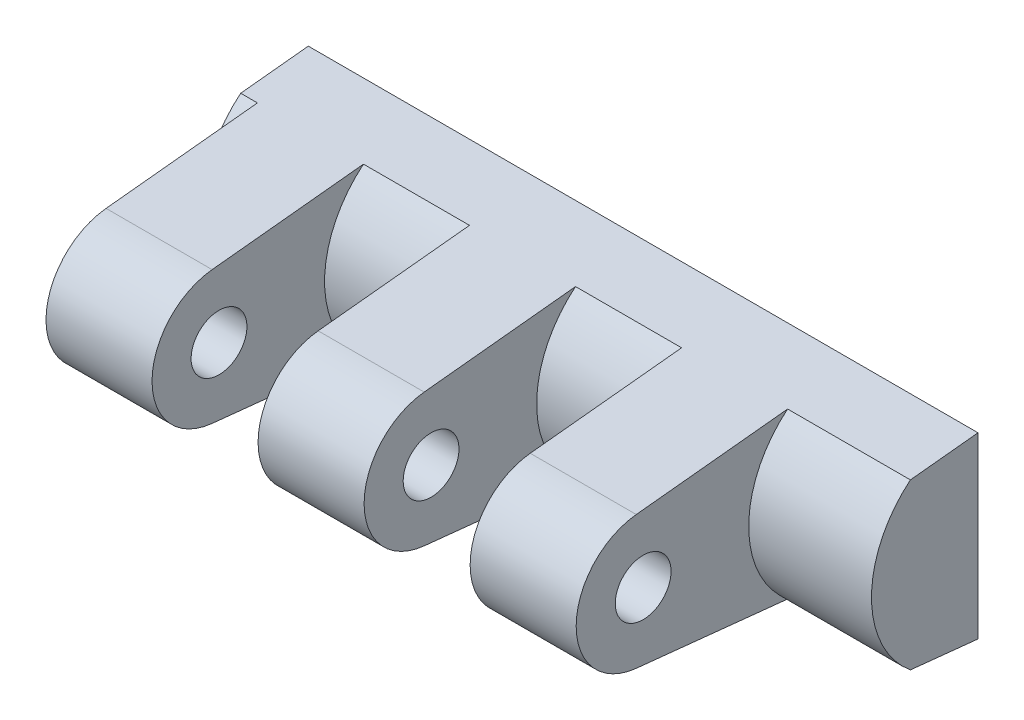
ISO-10303-21;
HEADER;
FILE_DESCRIPTION(('STEP AP214'),'2;1');
FILE_NAME('part.step','',(''),(''),'','','');
FILE_SCHEMA(('AUTOMOTIVE_DESIGN { 1 0 10303 214 1 1 1 1 }'));
ENDSEC;
DATA;
#1=APPLICATION_CONTEXT('core data for automotive mechanical design processes');
#2=APPLICATION_PROTOCOL_DEFINITION('international standard','automotive_design',2000,#1);
#3=PRODUCT_CONTEXT('',#1,'mechanical');
#4=PRODUCT('Part','Part','',(#3));
#5=PRODUCT_RELATED_PRODUCT_CATEGORY('part','',(#4));
#6=PRODUCT_DEFINITION_FORMATION('','',#4);
#7=PRODUCT_DEFINITION_CONTEXT('part definition',#1,'design');
#8=PRODUCT_DEFINITION('design','',#6,#7);
#9=PRODUCT_DEFINITION_SHAPE('','',#8);
#10=(LENGTH_UNIT() NAMED_UNIT(*) SI_UNIT(.MILLI.,.METRE.));
#11=(NAMED_UNIT(*) PLANE_ANGLE_UNIT() SI_UNIT($,.RADIAN.));
#12=(NAMED_UNIT(*) SI_UNIT($,.STERADIAN.) SOLID_ANGLE_UNIT());
#13=UNCERTAINTY_MEASURE_WITH_UNIT(LENGTH_MEASURE(1.E-05),#10,'distance_accuracy_value','');
#14=(GEOMETRIC_REPRESENTATION_CONTEXT(3) GLOBAL_UNCERTAINTY_ASSIGNED_CONTEXT((#13)) GLOBAL_UNIT_ASSIGNED_CONTEXT((#10,
#11,#12)) REPRESENTATION_CONTEXT('',''));
#15=CARTESIAN_POINT('',(0.,0.,0.));
#16=DIRECTION('',(0.,0.,1.));
#17=DIRECTION('',(1.,0.,0.));
#18=AXIS2_PLACEMENT_3D('',#15,#16,#17);
#19=CARTESIAN_POINT('',(-7.75,-4.,0.));
#20=DIRECTION('',(0.,-0.994679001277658,0.103022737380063));
#21=DIRECTION('',(0.,0.103022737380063,0.994679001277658));
#22=AXIS2_PLACEMENT_3D('',#19,#20,#21);
#23=PLANE('',#22);
#24=DIRECTION('',(1.,0.,0.));
#25=VECTOR('',#24,1.);
#26=CARTESIAN_POINT('',(-42.5,-3.68629621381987,3.028793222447));
#27=LINE('',#26,#25);
#28=CARTESIAN_POINT('',(-7.5,-3.68629621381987,3.02879322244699));
#29=VERTEX_POINT('',#28);
#30=CARTESIAN_POINT('',(-6.75,-3.68629621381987,3.028793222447));
#31=VERTEX_POINT('',#30);
#32=EDGE_CURVE('E175',#29,#31,#27,.T.);
#33=ORIENTED_EDGE('',*,*,#32,.F.);
#34=DIRECTION('',(0.,0.103022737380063,0.994679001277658));
#35=VECTOR('',#34,1.);
#36=CARTESIAN_POINT('',(-7.5,-4.,0.));
#37=LINE('',#36,#35);
#38=CARTESIAN_POINT('',(-7.5,-4.,0.));
#39=VERTEX_POINT('',#38);
#40=EDGE_CURVE('E29',#39,#29,#37,.T.);
#41=ORIENTED_EDGE('',*,*,#40,.F.);
#42=DIRECTION('',(1.,0.,0.));
#43=VECTOR('',#42,1.);
#44=CARTESIAN_POINT('',(-7.75,-4.,0.));
#45=LINE('',#44,#43);
#46=CARTESIAN_POINT('',(22.5,-4.,0.));
#47=VERTEX_POINT('',#46);
#48=EDGE_CURVE('E202',#39,#47,#45,.T.);
#49=ORIENTED_EDGE('',*,*,#48,.T.);
#50=DIRECTION('',(0.,-0.103022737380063,-0.994679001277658));
#51=VECTOR('',#50,1.);
#52=CARTESIAN_POINT('',(22.5,-3.68629621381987,3.028793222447));
#53=LINE('',#52,#51);
#54=CARTESIAN_POINT('',(22.5,-3.68629621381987,3.028793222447));
#55=VERTEX_POINT('',#54);
#56=EDGE_CURVE('E287',#55,#47,#53,.T.);
#57=ORIENTED_EDGE('',*,*,#56,.F.);
#58=DIRECTION('',(1.,0.,0.));
#59=VECTOR('',#58,1.);
#60=CARTESIAN_POINT('',(-42.5,-3.68629621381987,3.028793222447));
#61=LINE('',#60,#59);
#62=CARTESIAN_POINT('',(17.,-3.68629621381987,3.028793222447));
#63=VERTEX_POINT('',#62);
#64=EDGE_CURVE('E172',#63,#55,#61,.T.);
#65=ORIENTED_EDGE('',*,*,#64,.F.);
#66=DIRECTION('',(0.,-0.103022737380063,-0.994679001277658));
#67=VECTOR('',#66,1.);
#68=CARTESIAN_POINT('',(17.,-4.,0.));
#69=LINE('',#68,#67);
#70=CARTESIAN_POINT('',(17.,-2.984037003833,9.8090682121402));
#71=VERTEX_POINT('',#70);
#72=EDGE_CURVE('E191',#71,#63,#69,.T.);
#73=ORIENTED_EDGE('',*,*,#72,.F.);
#74=DIRECTION('',(1.,0.,0.));
#75=VECTOR('',#74,1.);
#76=CARTESIAN_POINT('',(-7.75,-2.984037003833,9.8090682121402));
#77=LINE('',#76,#75);
#78=CARTESIAN_POINT('',(12.25,-2.984037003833,9.8090682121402));
#79=VERTEX_POINT('',#78);
#80=EDGE_CURVE('E198',#79,#71,#77,.T.);
#81=ORIENTED_EDGE('',*,*,#80,.F.);
#82=DIRECTION('',(0.,0.103022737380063,0.994679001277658));
#83=VECTOR('',#82,1.);
#84=CARTESIAN_POINT('',(12.25,-4.,0.));
#85=LINE('',#84,#83);
#86=CARTESIAN_POINT('',(12.25,-3.68629621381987,3.028793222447));
#87=VERTEX_POINT('',#86);
#88=EDGE_CURVE('E188',#87,#79,#85,.T.);
#89=ORIENTED_EDGE('',*,*,#88,.F.);
#90=DIRECTION('',(1.,0.,0.));
#91=VECTOR('',#90,1.);
#92=CARTESIAN_POINT('',(-42.5,-3.68629621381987,3.028793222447));
#93=LINE('',#92,#91);
#94=CARTESIAN_POINT('',(7.5,-3.68629621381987,3.028793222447));
#95=VERTEX_POINT('',#94);
#96=EDGE_CURVE('E9',#95,#87,#93,.T.);
#97=ORIENTED_EDGE('',*,*,#96,.F.);
#98=DIRECTION('',(0.,-0.103022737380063,-0.994679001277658));
#99=VECTOR('',#98,1.);
#100=CARTESIAN_POINT('',(7.5,-4.,0.));
#101=LINE('',#100,#99);
#102=CARTESIAN_POINT('',(7.5,-2.984037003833,9.8090682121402));
#103=VERTEX_POINT('',#102);
#104=EDGE_CURVE('E185',#103,#95,#101,.T.);
#105=ORIENTED_EDGE('',*,*,#104,.F.);
#106=CARTESIAN_POINT('',(2.75,-2.984037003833,9.8090682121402));
#107=VERTEX_POINT('',#106);
#108=EDGE_CURVE('E200',#107,#103,#77,.T.);
#109=ORIENTED_EDGE('',*,*,#108,.F.);
#110=DIRECTION('',(0.,0.103022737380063,0.994679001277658));
#111=VECTOR('',#110,1.);
#112=CARTESIAN_POINT('',(2.75,-4.,0.));
#113=LINE('',#112,#111);
#114=CARTESIAN_POINT('',(2.75,-3.68629621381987,3.028793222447));
#115=VERTEX_POINT('',#114);
#116=EDGE_CURVE('E183',#115,#107,#113,.T.);
#117=ORIENTED_EDGE('',*,*,#116,.F.);
#118=DIRECTION('',(1.,0.,0.));
#119=VECTOR('',#118,1.);
#120=CARTESIAN_POINT('',(-42.5,-3.68629621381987,3.028793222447));
#121=LINE('',#120,#119);
#122=CARTESIAN_POINT('',(-2.,-3.68629621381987,3.028793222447));
#123=VERTEX_POINT('',#122);
#124=EDGE_CURVE('E22',#123,#115,#121,.T.);
#125=ORIENTED_EDGE('',*,*,#124,.F.);
#126=DIRECTION('',(0.,-0.103022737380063,-0.994679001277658));
#127=VECTOR('',#126,1.);
#128=CARTESIAN_POINT('',(-2.,-4.,0.));
#129=LINE('',#128,#127);
#130=CARTESIAN_POINT('',(-2.,-2.984037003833,9.8090682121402));
#131=VERTEX_POINT('',#130);
#132=EDGE_CURVE('E180',#131,#123,#129,.T.);
#133=ORIENTED_EDGE('',*,*,#132,.F.);
#134=CARTESIAN_POINT('',(-6.75,-2.984037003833,9.8090682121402));
#135=VERTEX_POINT('',#134);
#136=EDGE_CURVE('E201',#135,#131,#77,.T.);
#137=ORIENTED_EDGE('',*,*,#136,.F.);
#138=DIRECTION('',(0.,0.103022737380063,0.994679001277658));
#139=VECTOR('',#138,1.);
#140=CARTESIAN_POINT('',(-6.75,-4.,0.));
#141=LINE('',#140,#139);
#142=EDGE_CURVE('E177',#31,#135,#141,.T.);
#143=ORIENTED_EDGE('',*,*,#142,.F.);
#144=EDGE_LOOP('',(#33,#41,#49,#57,#65,#73,#81,#89,#97,#105,#109,#117,#125,#133,#137,#143));
#145=FACE_BOUND('',#144,.T.);
#146=ADVANCED_FACE('F14',(#145),#23,.T.);
#147=CARTESIAN_POINT('',(-7.75,2.984037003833,9.8090682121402));
#148=DIRECTION('',(0.,0.994679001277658,0.103022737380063));
#149=DIRECTION('',(0.,0.103022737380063,-0.994679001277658));
#150=AXIS2_PLACEMENT_3D('',#147,#148,#149);
#151=PLANE('',#150);
#152=DIRECTION('',(1.,0.,0.));
#153=VECTOR('',#152,1.);
#154=CARTESIAN_POINT('',(-7.75,4.,0.));
#155=LINE('',#154,#153);
#156=CARTESIAN_POINT('',(-7.5,4.,0.));
#157=VERTEX_POINT('',#156);
#158=CARTESIAN_POINT('',(22.5,4.,0.));
#159=VERTEX_POINT('',#158);
#160=EDGE_CURVE('E137',#157,#159,#155,.T.);
#161=ORIENTED_EDGE('',*,*,#160,.F.);
#162=DIRECTION('',(0.,0.103022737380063,-0.994679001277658));
#163=VECTOR('',#162,1.);
#164=CARTESIAN_POINT('',(-7.5,3.68629621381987,3.028793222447));
#165=LINE('',#164,#163);
#166=CARTESIAN_POINT('',(-7.5,3.68629621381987,3.028793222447));
#167=VERTEX_POINT('',#166);
#168=EDGE_CURVE('E127',#167,#157,#165,.T.);
#169=ORIENTED_EDGE('',*,*,#168,.F.);
#170=DIRECTION('',(-1.,0.,0.));
#171=VECTOR('',#170,1.);
#172=CARTESIAN_POINT('',(-42.5,3.68629621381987,3.028793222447));
#173=LINE('',#172,#171);
#174=CARTESIAN_POINT('',(-6.75,3.68629621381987,3.028793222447));
#175=VERTEX_POINT('',#174);
#176=EDGE_CURVE('E135',#167,#175,#173,.F.);
#177=ORIENTED_EDGE('',*,*,#176,.T.);
#178=DIRECTION('',(0.,-0.103022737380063,0.994679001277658));
#179=VECTOR('',#178,1.);
#180=CARTESIAN_POINT('',(-6.75,2.984037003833,9.8090682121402));
#181=LINE('',#180,#179);
#182=CARTESIAN_POINT('',(-6.75,2.984037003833,9.8090682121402));
#183=VERTEX_POINT('',#182);
#184=EDGE_CURVE('E144',#175,#183,#181,.T.);
#185=ORIENTED_EDGE('',*,*,#184,.T.);
#186=DIRECTION('',(1.,0.,0.));
#187=VECTOR('',#186,1.);
#188=CARTESIAN_POINT('',(-7.75,2.984037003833,9.8090682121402));
#189=LINE('',#188,#187);
#190=CARTESIAN_POINT('',(-2.,2.984037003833,9.8090682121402));
#191=VERTEX_POINT('',#190);
#192=EDGE_CURVE('E197',#183,#191,#189,.T.);
#193=ORIENTED_EDGE('',*,*,#192,.T.);
#194=DIRECTION('',(0.,0.103022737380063,-0.994679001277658));
#195=VECTOR('',#194,1.);
#196=CARTESIAN_POINT('',(-2.,2.984037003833,9.8090682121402));
#197=LINE('',#196,#195);
#198=CARTESIAN_POINT('',(-2.,3.68629621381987,3.028793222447));
#199=VERTEX_POINT('',#198);
#200=EDGE_CURVE('E237',#191,#199,#197,.T.);
#201=ORIENTED_EDGE('',*,*,#200,.T.);
#202=DIRECTION('',(-1.,0.,0.));
#203=VECTOR('',#202,1.);
#204=CARTESIAN_POINT('',(-42.5,3.68629621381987,3.028793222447));
#205=LINE('',#204,#203);
#206=CARTESIAN_POINT('',(2.75,3.68629621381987,3.028793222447));
#207=VERTEX_POINT('',#206);
#208=EDGE_CURVE('E145',#199,#207,#205,.F.);
#209=ORIENTED_EDGE('',*,*,#208,.T.);
#210=DIRECTION('',(0.,-0.103022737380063,0.994679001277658));
#211=VECTOR('',#210,1.);
#212=CARTESIAN_POINT('',(2.75,2.984037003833,9.8090682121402));
#213=LINE('',#212,#211);
#214=CARTESIAN_POINT('',(2.75,2.984037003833,9.8090682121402));
#215=VERTEX_POINT('',#214);
#216=EDGE_CURVE('E150',#207,#215,#213,.T.);
#217=ORIENTED_EDGE('',*,*,#216,.T.);
#218=CARTESIAN_POINT('',(7.5,2.984037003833,9.8090682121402));
#219=VERTEX_POINT('',#218);
#220=EDGE_CURVE('E196',#215,#219,#189,.T.);
#221=ORIENTED_EDGE('',*,*,#220,.T.);
#222=DIRECTION('',(0.,0.103022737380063,-0.994679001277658));
#223=VECTOR('',#222,1.);
#224=CARTESIAN_POINT('',(7.5,2.984037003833,9.8090682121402));
#225=LINE('',#224,#223);
#226=CARTESIAN_POINT('',(7.5,3.68629621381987,3.028793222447));
#227=VERTEX_POINT('',#226);
#228=EDGE_CURVE('E246',#219,#227,#225,.T.);
#229=ORIENTED_EDGE('',*,*,#228,.T.);
#230=DIRECTION('',(-1.,0.,0.));
#231=VECTOR('',#230,1.);
#232=CARTESIAN_POINT('',(-42.5,3.68629621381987,3.028793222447));
#233=LINE('',#232,#231);
#234=CARTESIAN_POINT('',(12.25,3.68629621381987,3.028793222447));
#235=VERTEX_POINT('',#234);
#236=EDGE_CURVE('E251',#227,#235,#233,.F.);
#237=ORIENTED_EDGE('',*,*,#236,.T.);
#238=DIRECTION('',(0.,-0.103022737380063,0.994679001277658));
#239=VECTOR('',#238,1.);
#240=CARTESIAN_POINT('',(12.25,2.984037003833,9.8090682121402));
#241=LINE('',#240,#239);
#242=CARTESIAN_POINT('',(12.25,2.984037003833,9.8090682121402));
#243=VERTEX_POINT('',#242);
#244=EDGE_CURVE('E243',#235,#243,#241,.T.);
#245=ORIENTED_EDGE('',*,*,#244,.T.);
#246=CARTESIAN_POINT('',(17.,2.984037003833,9.8090682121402));
#247=VERTEX_POINT('',#246);
#248=EDGE_CURVE('E194',#243,#247,#189,.T.);
#249=ORIENTED_EDGE('',*,*,#248,.T.);
#250=DIRECTION('',(0.,0.103022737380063,-0.994679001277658));
#251=VECTOR('',#250,1.);
#252=CARTESIAN_POINT('',(17.,2.984037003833,9.8090682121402));
#253=LINE('',#252,#251);
#254=CARTESIAN_POINT('',(17.,3.68629621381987,3.028793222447));
#255=VERTEX_POINT('',#254);
#256=EDGE_CURVE('E156',#247,#255,#253,.T.);
#257=ORIENTED_EDGE('',*,*,#256,.T.);
#258=DIRECTION('',(-1.,0.,0.));
#259=VECTOR('',#258,1.);
#260=CARTESIAN_POINT('',(-42.5,3.68629621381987,3.028793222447));
#261=LINE('',#260,#259);
#262=CARTESIAN_POINT('',(22.5,3.68629621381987,3.02879322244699));
#263=VERTEX_POINT('',#262);
#264=EDGE_CURVE('E147',#255,#263,#261,.F.);
#265=ORIENTED_EDGE('',*,*,#264,.T.);
#266=DIRECTION('',(0.,-0.103022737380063,0.994679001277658));
#267=VECTOR('',#266,1.);
#268=CARTESIAN_POINT('',(22.5,4.,0.));
#269=LINE('',#268,#267);
#270=EDGE_CURVE('E37',#159,#263,#269,.T.);
#271=ORIENTED_EDGE('',*,*,#270,.F.);
#272=EDGE_LOOP('',(#161,#169,#177,#185,#193,#201,#209,#217,#221,#229,#237,#245,#249,#257,#265,#271));
#273=FACE_BOUND('',#272,.T.);
#274=ADVANCED_FACE('F16',(#273),#151,.T.);
#275=CARTESIAN_POINT('',(-7.75,4.,0.));
#276=DIRECTION('',(0.,0.,-1.));
#277=DIRECTION('',(-1.,0.,0.));
#278=AXIS2_PLACEMENT_3D('',#275,#276,#277);
#279=PLANE('',#278);
#280=CARTESIAN_POINT('',(0.,0.,0.));
#281=DIRECTION('',(0.,0.,1.));
#282=DIRECTION('',(-1.,0.,0.));
#283=AXIS2_PLACEMENT_3D('',#280,#281,#282);
#284=CIRCLE('',#283,1.5);
#285=CARTESIAN_POINT('',(-1.5,0.,0.));
#286=VERTEX_POINT('',#285);
#287=EDGE_CURVE('E279',#286,#286,#284,.T.);
#288=ORIENTED_EDGE('',*,*,#287,.T.);
#289=EDGE_LOOP('',(#288));
#290=FACE_BOUND('',#289,.T.);
#291=CARTESIAN_POINT('',(15.,0.,0.));
#292=DIRECTION('',(0.,0.,1.));
#293=DIRECTION('',(-1.,0.,0.));
#294=AXIS2_PLACEMENT_3D('',#291,#292,#293);
#295=CIRCLE('',#294,1.5);
#296=CARTESIAN_POINT('',(13.5,0.,0.));
#297=VERTEX_POINT('',#296);
#298=EDGE_CURVE('E273',#297,#297,#295,.T.);
#299=ORIENTED_EDGE('',*,*,#298,.T.);
#300=EDGE_LOOP('',(#299));
#301=FACE_BOUND('',#300,.T.);
#302=ORIENTED_EDGE('',*,*,#48,.F.);
#303=DIRECTION('',(0.,-1.,0.));
#304=VECTOR('',#303,1.);
#305=CARTESIAN_POINT('',(-7.5,4.,0.));
#306=LINE('',#305,#304);
#307=EDGE_CURVE('E138',#157,#39,#306,.T.);
#308=ORIENTED_EDGE('',*,*,#307,.F.);
#309=ORIENTED_EDGE('',*,*,#160,.T.);
#310=DIRECTION('',(0.,1.,0.));
#311=VECTOR('',#310,1.);
#312=CARTESIAN_POINT('',(22.5,-4.,0.));
#313=LINE('',#312,#311);
#314=EDGE_CURVE('E285',#47,#159,#313,.T.);
#315=ORIENTED_EDGE('',*,*,#314,.F.);
#316=EDGE_LOOP('',(#302,#308,#309,#315));
#317=FACE_BOUND('',#316,.T.);
#318=ADVANCED_FACE('F298',(#290,#301,#317),#279,.T.);
#319=CARTESIAN_POINT('',(-42.5,0.,0.));
#320=DIRECTION('',(1.,0.,0.));
#321=DIRECTION('',(0.,-1.,0.));
#322=AXIS2_PLACEMENT_3D('',#319,#320,#321);
#323=CYLINDRICAL_SURFACE('',#322,4.7709923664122);
#324=ORIENTED_EDGE('',*,*,#176,.F.);
#325=CARTESIAN_POINT('',(-7.5,0.,0.));
#326=DIRECTION('',(-1.,0.,0.));
#327=DIRECTION('',(0.,0.,1.));
#328=AXIS2_PLACEMENT_3D('',#325,#326,#327);
#329=CIRCLE('',#328,4.77099236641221);
#330=EDGE_CURVE('E124',#29,#167,#329,.T.);
#331=ORIENTED_EDGE('',*,*,#330,.F.);
#332=ORIENTED_EDGE('',*,*,#32,.T.);
#333=CARTESIAN_POINT('',(-6.75,0.,0.));
#334=DIRECTION('',(-1.,0.,0.));
#335=DIRECTION('',(0.,-1.,0.));
#336=AXIS2_PLACEMENT_3D('',#333,#334,#335);
#337=CIRCLE('',#336,4.7709923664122);
#338=EDGE_CURVE('E142',#31,#175,#337,.T.);
#339=ORIENTED_EDGE('',*,*,#338,.T.);
#340=EDGE_LOOP('',(#324,#331,#332,#339));
#341=FACE_BOUND('',#340,.T.);
#342=ADVANCED_FACE('F140',(#341),#323,.T.);
#343=CARTESIAN_POINT('',(-42.5,0.,0.));
#344=DIRECTION('',(1.,0.,0.));
#345=DIRECTION('',(0.,-1.,0.));
#346=AXIS2_PLACEMENT_3D('',#343,#344,#345);
#347=CYLINDRICAL_SURFACE('',#346,4.7709923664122);
#348=ORIENTED_EDGE('',*,*,#64,.T.);
#349=CARTESIAN_POINT('',(22.5,0.,0.));
#350=DIRECTION('',(1.,0.,0.));
#351=DIRECTION('',(0.,0.,-1.));
#352=AXIS2_PLACEMENT_3D('',#349,#350,#351);
#353=CIRCLE('',#352,4.77099236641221);
#354=EDGE_CURVE('E290',#263,#55,#353,.T.);
#355=ORIENTED_EDGE('',*,*,#354,.F.);
#356=ORIENTED_EDGE('',*,*,#264,.F.);
#357=CARTESIAN_POINT('',(17.,0.,0.));
#358=DIRECTION('',(-1.,0.,0.));
#359=DIRECTION('',(0.,-1.,0.));
#360=AXIS2_PLACEMENT_3D('',#357,#358,#359);
#361=CIRCLE('',#360,4.7709923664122);
#362=EDGE_CURVE('E169',#63,#255,#361,.T.);
#363=ORIENTED_EDGE('',*,*,#362,.F.);
#364=EDGE_LOOP('',(#348,#355,#356,#363));
#365=FACE_BOUND('',#364,.T.);
#366=ADVANCED_FACE('F303',(#365),#347,.T.);
#367=CARTESIAN_POINT('',(17.,-4.7709923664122,0.));
#368=DIRECTION('',(1.,0.,0.));
#369=DIRECTION('',(0.,-1.,0.));
#370=AXIS2_PLACEMENT_3D('',#367,#368,#369);
#371=PLANE('',#370);
#372=CARTESIAN_POINT('',(17.,0.,9.5));
#373=DIRECTION('',(-1.,0.,0.));
#374=DIRECTION('',(0.,-1.,0.));
#375=AXIS2_PLACEMENT_3D('',#372,#373,#374);
#376=CIRCLE('',#375,3.);
#377=EDGE_CURVE('E219',#247,#71,#376,.F.);
#378=ORIENTED_EDGE('',*,*,#377,.T.);
#379=ORIENTED_EDGE('',*,*,#72,.T.);
#380=ORIENTED_EDGE('',*,*,#362,.T.);
#381=ORIENTED_EDGE('',*,*,#256,.F.);
#382=EDGE_LOOP('',(#378,#379,#380,#381));
#383=FACE_BOUND('',#382,.T.);
#384=CARTESIAN_POINT('',(17.,0.,9.5));
#385=DIRECTION('',(-1.,0.,0.));
#386=DIRECTION('',(0.,-1.,0.));
#387=AXIS2_PLACEMENT_3D('',#384,#385,#386);
#388=CIRCLE('',#387,1.25);
#389=CARTESIAN_POINT('',(17.,-1.25,9.5));
#390=VERTEX_POINT('',#389);
#391=EDGE_CURVE('E266',#390,#390,#388,.F.);
#392=ORIENTED_EDGE('',*,*,#391,.F.);
#393=EDGE_LOOP('',(#392));
#394=FACE_BOUND('',#393,.T.);
#395=ADVANCED_FACE('F309',(#383,#394),#371,.T.);
#396=CARTESIAN_POINT('',(12.25,-15.,0.));
#397=DIRECTION('',(-1.,0.,0.));
#398=DIRECTION('',(0.,1.,0.));
#399=AXIS2_PLACEMENT_3D('',#396,#397,#398);
#400=PLANE('',#399);
#401=CARTESIAN_POINT('',(12.25,0.,0.));
#402=DIRECTION('',(-1.,0.,0.));
#403=DIRECTION('',(0.,-1.,0.));
#404=AXIS2_PLACEMENT_3D('',#401,#402,#403);
#405=CIRCLE('',#404,4.7709923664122);
#406=EDGE_CURVE('E166',#87,#235,#405,.T.);
#407=ORIENTED_EDGE('',*,*,#406,.F.);
#408=ORIENTED_EDGE('',*,*,#88,.T.);
#409=CARTESIAN_POINT('',(12.25,0.,9.5));
#410=DIRECTION('',(1.,0.,0.));
#411=DIRECTION('',(0.,1.,0.));
#412=AXIS2_PLACEMENT_3D('',#409,#410,#411);
#413=CIRCLE('',#412,3.);
#414=EDGE_CURVE('E216',#79,#243,#413,.F.);
#415=ORIENTED_EDGE('',*,*,#414,.T.);
#416=ORIENTED_EDGE('',*,*,#244,.F.);
#417=EDGE_LOOP('',(#407,#408,#415,#416));
#418=FACE_BOUND('',#417,.T.);
#419=CARTESIAN_POINT('',(12.25,0.,9.5));
#420=DIRECTION('',(1.,0.,0.));
#421=DIRECTION('',(0.,1.,0.));
#422=AXIS2_PLACEMENT_3D('',#419,#420,#421);
#423=CIRCLE('',#422,1.25);
#424=CARTESIAN_POINT('',(12.25,1.25,9.5));
#425=VERTEX_POINT('',#424);
#426=EDGE_CURVE('E269',#425,#425,#423,.F.);
#427=ORIENTED_EDGE('',*,*,#426,.F.);
#428=EDGE_LOOP('',(#427));
#429=FACE_BOUND('',#428,.T.);
#430=ADVANCED_FACE('F316',(#418,#429),#400,.T.);
#431=CARTESIAN_POINT('',(-7.75,0.,9.5));
#432=DIRECTION('',(1.,0.,0.));
#433=DIRECTION('',(0.,-1.,0.));
#434=AXIS2_PLACEMENT_3D('',#431,#432,#433);
#435=CYLINDRICAL_SURFACE('',#434,3.);
#436=ORIENTED_EDGE('',*,*,#248,.F.);
#437=ORIENTED_EDGE('',*,*,#414,.F.);
#438=ORIENTED_EDGE('',*,*,#80,.T.);
#439=ORIENTED_EDGE('',*,*,#377,.F.);
#440=EDGE_LOOP('',(#436,#437,#438,#439));
#441=FACE_BOUND('',#440,.T.);
#442=ADVANCED_FACE('F312',(#441),#435,.T.);
#443=ORIENTED_EDGE('',*,*,#220,.F.);
#444=CARTESIAN_POINT('',(2.75,0.,9.5));
#445=DIRECTION('',(1.,0.,0.));
#446=DIRECTION('',(0.,1.,0.));
#447=AXIS2_PLACEMENT_3D('',#444,#445,#446);
#448=CIRCLE('',#447,3.);
#449=EDGE_CURVE('E210',#107,#215,#448,.F.);
#450=ORIENTED_EDGE('',*,*,#449,.F.);
#451=ORIENTED_EDGE('',*,*,#108,.T.);
#452=CARTESIAN_POINT('',(7.5,0.,9.5));
#453=DIRECTION('',(-1.,0.,0.));
#454=DIRECTION('',(0.,-1.,0.));
#455=AXIS2_PLACEMENT_3D('',#452,#453,#454);
#456=CIRCLE('',#455,3.);
#457=EDGE_CURVE('E213',#219,#103,#456,.F.);
#458=ORIENTED_EDGE('',*,*,#457,.F.);
#459=EDGE_LOOP('',(#443,#450,#451,#458));
#460=FACE_BOUND('',#459,.T.);
#461=ADVANCED_FACE('F326',(#460),#435,.T.);
#462=ORIENTED_EDGE('',*,*,#192,.F.);
#463=CARTESIAN_POINT('',(-6.75,0.,9.5));
#464=DIRECTION('',(1.,0.,0.));
#465=DIRECTION('',(0.,1.,0.));
#466=AXIS2_PLACEMENT_3D('',#463,#464,#465);
#467=CIRCLE('',#466,3.);
#468=EDGE_CURVE('E205',#135,#183,#467,.F.);
#469=ORIENTED_EDGE('',*,*,#468,.F.);
#470=ORIENTED_EDGE('',*,*,#136,.T.);
#471=CARTESIAN_POINT('',(-2.,0.,9.5));
#472=DIRECTION('',(-1.,0.,0.));
#473=DIRECTION('',(0.,-1.,0.));
#474=AXIS2_PLACEMENT_3D('',#471,#472,#473);
#475=CIRCLE('',#474,3.);
#476=EDGE_CURVE('E208',#191,#131,#475,.F.);
#477=ORIENTED_EDGE('',*,*,#476,.F.);
#478=EDGE_LOOP('',(#462,#469,#470,#477));
#479=FACE_BOUND('',#478,.T.);
#480=ADVANCED_FACE('F330',(#479),#435,.T.);
#481=CARTESIAN_POINT('',(-6.75,-15.,0.));
#482=DIRECTION('',(-1.,0.,0.));
#483=DIRECTION('',(0.,1.,0.));
#484=AXIS2_PLACEMENT_3D('',#481,#482,#483);
#485=PLANE('',#484);
#486=CARTESIAN_POINT('',(-6.75,0.,9.5));
#487=DIRECTION('',(1.,0.,0.));
#488=DIRECTION('',(0.,1.,0.));
#489=AXIS2_PLACEMENT_3D('',#486,#487,#488);
#490=CIRCLE('',#489,1.25);
#491=CARTESIAN_POINT('',(-6.75,1.25,9.5));
#492=VERTEX_POINT('',#491);
#493=EDGE_CURVE('E253',#492,#492,#490,.T.);
#494=ORIENTED_EDGE('',*,*,#493,.T.);
#495=EDGE_LOOP('',(#494));
#496=FACE_BOUND('',#495,.T.);
#497=ORIENTED_EDGE('',*,*,#338,.F.);
#498=ORIENTED_EDGE('',*,*,#142,.T.);
#499=ORIENTED_EDGE('',*,*,#468,.T.);
#500=ORIENTED_EDGE('',*,*,#184,.F.);
#501=EDGE_LOOP('',(#497,#498,#499,#500));
#502=FACE_BOUND('',#501,.T.);
#503=ADVANCED_FACE('F333',(#496,#502),#485,.T.);
#504=CARTESIAN_POINT('',(-2.,-4.7709923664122,0.));
#505=DIRECTION('',(1.,0.,0.));
#506=DIRECTION('',(0.,-1.,0.));
#507=AXIS2_PLACEMENT_3D('',#504,#505,#506);
#508=PLANE('',#507);
#509=CARTESIAN_POINT('',(-2.,0.,9.5));
#510=DIRECTION('',(-1.,0.,0.));
#511=DIRECTION('',(0.,-1.,0.));
#512=AXIS2_PLACEMENT_3D('',#509,#510,#511);
#513=CIRCLE('',#512,1.25);
#514=CARTESIAN_POINT('',(-2.,-1.25,9.5));
#515=VERTEX_POINT('',#514);
#516=EDGE_CURVE('E256',#515,#515,#513,.T.);
#517=ORIENTED_EDGE('',*,*,#516,.T.);
#518=EDGE_LOOP('',(#517));
#519=FACE_BOUND('',#518,.T.);
#520=ORIENTED_EDGE('',*,*,#476,.T.);
#521=ORIENTED_EDGE('',*,*,#132,.T.);
#522=CARTESIAN_POINT('',(-2.,0.,0.));
#523=DIRECTION('',(-1.,0.,0.));
#524=DIRECTION('',(0.,-1.,0.));
#525=AXIS2_PLACEMENT_3D('',#522,#523,#524);
#526=CIRCLE('',#525,4.7709923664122);
#527=EDGE_CURVE('E160',#123,#199,#526,.T.);
#528=ORIENTED_EDGE('',*,*,#527,.T.);
#529=ORIENTED_EDGE('',*,*,#200,.F.);
#530=EDGE_LOOP('',(#520,#521,#528,#529));
#531=FACE_BOUND('',#530,.T.);
#532=ADVANCED_FACE('F331',(#519,#531),#508,.T.);
#533=CARTESIAN_POINT('',(2.75,-15.,0.));
#534=DIRECTION('',(-1.,0.,0.));
#535=DIRECTION('',(0.,1.,0.));
#536=AXIS2_PLACEMENT_3D('',#533,#534,#535);
#537=PLANE('',#536);
#538=CARTESIAN_POINT('',(2.75,0.,9.5));
#539=DIRECTION('',(1.,0.,0.));
#540=DIRECTION('',(0.,1.,0.));
#541=AXIS2_PLACEMENT_3D('',#538,#539,#540);
#542=CIRCLE('',#541,1.25);
#543=CARTESIAN_POINT('',(2.75,1.25,9.5));
#544=VERTEX_POINT('',#543);
#545=EDGE_CURVE('E259',#544,#544,#542,.T.);
#546=ORIENTED_EDGE('',*,*,#545,.T.);
#547=EDGE_LOOP('',(#546));
#548=FACE_BOUND('',#547,.T.);
#549=CARTESIAN_POINT('',(2.75,0.,0.));
#550=DIRECTION('',(-1.,0.,0.));
#551=DIRECTION('',(0.,-1.,0.));
#552=AXIS2_PLACEMENT_3D('',#549,#550,#551);
#553=CIRCLE('',#552,4.7709923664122);
#554=EDGE_CURVE('E162',#115,#207,#553,.T.);
#555=ORIENTED_EDGE('',*,*,#554,.F.);
#556=ORIENTED_EDGE('',*,*,#116,.T.);
#557=ORIENTED_EDGE('',*,*,#449,.T.);
#558=ORIENTED_EDGE('',*,*,#216,.F.);
#559=EDGE_LOOP('',(#555,#556,#557,#558));
#560=FACE_BOUND('',#559,.T.);
#561=ADVANCED_FACE('F234',(#548,#560),#537,.T.);
#562=CARTESIAN_POINT('',(-42.5,0.,0.));
#563=DIRECTION('',(1.,0.,0.));
#564=DIRECTION('',(0.,-1.,0.));
#565=AXIS2_PLACEMENT_3D('',#562,#563,#564);
#566=CYLINDRICAL_SURFACE('',#565,4.7709923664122);
#567=ORIENTED_EDGE('',*,*,#527,.F.);
#568=ORIENTED_EDGE('',*,*,#124,.T.);
#569=ORIENTED_EDGE('',*,*,#554,.T.);
#570=ORIENTED_EDGE('',*,*,#208,.F.);
#571=EDGE_LOOP('',(#567,#568,#569,#570));
#572=FACE_BOUND('',#571,.T.);
#573=ADVANCED_FACE('F225',(#572),#566,.T.);
#574=CARTESIAN_POINT('',(-42.5,0.,0.));
#575=DIRECTION('',(1.,0.,0.));
#576=DIRECTION('',(0.,-1.,0.));
#577=AXIS2_PLACEMENT_3D('',#574,#575,#576);
#578=CYLINDRICAL_SURFACE('',#577,4.7709923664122);
#579=CARTESIAN_POINT('',(7.5,0.,0.));
#580=DIRECTION('',(-1.,0.,0.));
#581=DIRECTION('',(0.,-1.,0.));
#582=AXIS2_PLACEMENT_3D('',#579,#580,#581);
#583=CIRCLE('',#582,4.7709923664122);
#584=EDGE_CURVE('E164',#95,#227,#583,.T.);
#585=ORIENTED_EDGE('',*,*,#584,.F.);
#586=ORIENTED_EDGE('',*,*,#96,.T.);
#587=ORIENTED_EDGE('',*,*,#406,.T.);
#588=ORIENTED_EDGE('',*,*,#236,.F.);
#589=EDGE_LOOP('',(#585,#586,#587,#588));
#590=FACE_BOUND('',#589,.T.);
#591=ADVANCED_FACE('F320',(#590),#578,.T.);
#592=CARTESIAN_POINT('',(7.5,-4.7709923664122,0.));
#593=DIRECTION('',(1.,0.,0.));
#594=DIRECTION('',(0.,-1.,0.));
#595=AXIS2_PLACEMENT_3D('',#592,#593,#594);
#596=PLANE('',#595);
#597=CARTESIAN_POINT('',(7.5,0.,9.5));
#598=DIRECTION('',(-1.,0.,0.));
#599=DIRECTION('',(0.,-1.,0.));
#600=AXIS2_PLACEMENT_3D('',#597,#598,#599);
#601=CIRCLE('',#600,1.25);
#602=CARTESIAN_POINT('',(7.5,-1.25,9.5));
#603=VERTEX_POINT('',#602);
#604=EDGE_CURVE('E262',#603,#603,#601,.T.);
#605=ORIENTED_EDGE('',*,*,#604,.T.);
#606=EDGE_LOOP('',(#605));
#607=FACE_BOUND('',#606,.T.);
#608=ORIENTED_EDGE('',*,*,#457,.T.);
#609=ORIENTED_EDGE('',*,*,#104,.T.);
#610=ORIENTED_EDGE('',*,*,#584,.T.);
#611=ORIENTED_EDGE('',*,*,#228,.F.);
#612=EDGE_LOOP('',(#608,#609,#610,#611));
#613=FACE_BOUND('',#612,.T.);
#614=ADVANCED_FACE('F323',(#607,#613),#596,.T.);
#615=CARTESIAN_POINT('',(-7.75,0.,9.5));
#616=DIRECTION('',(1.,0.,0.));
#617=DIRECTION('',(0.,-1.,0.));
#618=AXIS2_PLACEMENT_3D('',#615,#616,#617);
#619=CYLINDRICAL_SURFACE('',#618,1.25);
#620=ORIENTED_EDGE('',*,*,#545,.F.);
#621=EDGE_LOOP('',(#620));
#622=FACE_BOUND('',#621,.T.);
#623=ORIENTED_EDGE('',*,*,#604,.F.);
#624=EDGE_LOOP('',(#623));
#625=FACE_BOUND('',#624,.T.);
#626=ADVANCED_FACE('F390',(#622,#625),#619,.F.);
#627=ORIENTED_EDGE('',*,*,#493,.F.);
#628=EDGE_LOOP('',(#627));
#629=FACE_BOUND('',#628,.T.);
#630=ORIENTED_EDGE('',*,*,#516,.F.);
#631=EDGE_LOOP('',(#630));
#632=FACE_BOUND('',#631,.T.);
#633=ADVANCED_FACE('F380',(#629,#632),#619,.F.);
#634=CARTESIAN_POINT('',(22.75,0.,9.5));
#635=DIRECTION('',(-1.,0.,0.));
#636=DIRECTION('',(0.,1.,0.));
#637=AXIS2_PLACEMENT_3D('',#634,#635,#636);
#638=CYLINDRICAL_SURFACE('',#637,1.25);
#639=ORIENTED_EDGE('',*,*,#391,.T.);
#640=EDGE_LOOP('',(#639));
#641=FACE_BOUND('',#640,.T.);
#642=ORIENTED_EDGE('',*,*,#426,.T.);
#643=EDGE_LOOP('',(#642));
#644=FACE_BOUND('',#643,.T.);
#645=ADVANCED_FACE('F369',(#641,#644),#638,.F.);
#646=CARTESIAN_POINT('',(15.,0.,4.));
#647=DIRECTION('',(0.,0.,-1.));
#648=DIRECTION('',(-1.,0.,0.));
#649=AXIS2_PLACEMENT_3D('',#646,#647,#648);
#650=CYLINDRICAL_SURFACE('',#649,1.5);
#651=CARTESIAN_POINT('',(15.,0.,4.));
#652=DIRECTION('',(0.,0.,1.));
#653=DIRECTION('',(-1.,0.,0.));
#654=AXIS2_PLACEMENT_3D('',#651,#652,#653);
#655=CIRCLE('',#654,1.5);
#656=CARTESIAN_POINT('',(13.5,0.,4.));
#657=VERTEX_POINT('',#656);
#658=EDGE_CURVE('E272',#657,#657,#655,.T.);
#659=ORIENTED_EDGE('',*,*,#658,.T.);
#660=EDGE_LOOP('',(#659));
#661=FACE_BOUND('',#660,.T.);
#662=ORIENTED_EDGE('',*,*,#298,.F.);
#663=EDGE_LOOP('',(#662));
#664=FACE_BOUND('',#663,.T.);
#665=ADVANCED_FACE('F366',(#661,#664),#650,.F.);
#666=CARTESIAN_POINT('',(15.,0.,4.));
#667=DIRECTION('',(0.,0.,1.));
#668=DIRECTION('',(0.,1.,0.));
#669=AXIS2_PLACEMENT_3D('',#666,#667,#668);
#670=PLANE('',#669);
#671=ORIENTED_EDGE('',*,*,#658,.F.);
#672=EDGE_LOOP('',(#671));
#673=FACE_BOUND('',#672,.T.);
#674=ADVANCED_FACE('F368',(#673),#670,.F.);
#675=CARTESIAN_POINT('',(0.,0.,4.));
#676=DIRECTION('',(0.,0.,-1.));
#677=DIRECTION('',(-1.,0.,0.));
#678=AXIS2_PLACEMENT_3D('',#675,#676,#677);
#679=CYLINDRICAL_SURFACE('',#678,1.5);
#680=CARTESIAN_POINT('',(0.,0.,4.));
#681=DIRECTION('',(0.,0.,1.));
#682=DIRECTION('',(-1.,0.,0.));
#683=AXIS2_PLACEMENT_3D('',#680,#681,#682);
#684=CIRCLE('',#683,1.5);
#685=CARTESIAN_POINT('',(-1.5,0.,4.));
#686=VERTEX_POINT('',#685);
#687=EDGE_CURVE('E276',#686,#686,#684,.T.);
#688=ORIENTED_EDGE('',*,*,#687,.T.);
#689=EDGE_LOOP('',(#688));
#690=FACE_BOUND('',#689,.T.);
#691=ORIENTED_EDGE('',*,*,#287,.F.);
#692=EDGE_LOOP('',(#691));
#693=FACE_BOUND('',#692,.T.);
#694=ADVANCED_FACE('F377',(#690,#693),#679,.F.);
#695=CARTESIAN_POINT('',(0.,0.,4.));
#696=DIRECTION('',(0.,0.,1.));
#697=DIRECTION('',(0.,1.,0.));
#698=AXIS2_PLACEMENT_3D('',#695,#696,#697);
#699=PLANE('',#698);
#700=ORIENTED_EDGE('',*,*,#687,.F.);
#701=EDGE_LOOP('',(#700));
#702=FACE_BOUND('',#701,.T.);
#703=ADVANCED_FACE('F386',(#702),#699,.F.);
#704=CARTESIAN_POINT('',(22.5,0.,0.));
#705=DIRECTION('',(1.,0.,0.));
#706=DIRECTION('',(0.,0.,-1.));
#707=AXIS2_PLACEMENT_3D('',#704,#705,#706);
#708=PLANE('',#707);
#709=ORIENTED_EDGE('',*,*,#354,.T.);
#710=ORIENTED_EDGE('',*,*,#56,.T.);
#711=ORIENTED_EDGE('',*,*,#314,.T.);
#712=ORIENTED_EDGE('',*,*,#270,.T.);
#713=EDGE_LOOP('',(#709,#710,#711,#712));
#714=FACE_BOUND('',#713,.T.);
#715=ADVANCED_FACE('F299',(#714),#708,.T.);
#716=CARTESIAN_POINT('',(-7.5,0.,0.));
#717=DIRECTION('',(-1.,0.,0.));
#718=DIRECTION('',(0.,0.,1.));
#719=AXIS2_PLACEMENT_3D('',#716,#717,#718);
#720=PLANE('',#719);
#721=ORIENTED_EDGE('',*,*,#330,.T.);
#722=ORIENTED_EDGE('',*,*,#168,.T.);
#723=ORIENTED_EDGE('',*,*,#307,.T.);
#724=ORIENTED_EDGE('',*,*,#40,.T.);
#725=EDGE_LOOP('',(#721,#722,#723,#724));
#726=FACE_BOUND('',#725,.T.);
#727=ADVANCED_FACE('F126',(#726),#720,.T.);
#728=CLOSED_SHELL('',(#146,#274,#318,#342,#366,#395,#430,#442,#461,#480,#503,#532,#561,#573,
#591,#614,#626,#633,#645,#665,#674,#694,#703,#715,#727));
#729=MANIFOLD_SOLID_BREP('B1',#728);
#730=ADVANCED_BREP_SHAPE_REPRESENTATION('',(#18,#729),#14);
#731=SHAPE_DEFINITION_REPRESENTATION(#9,#730);
ENDSEC;
END-ISO-10303-21;
